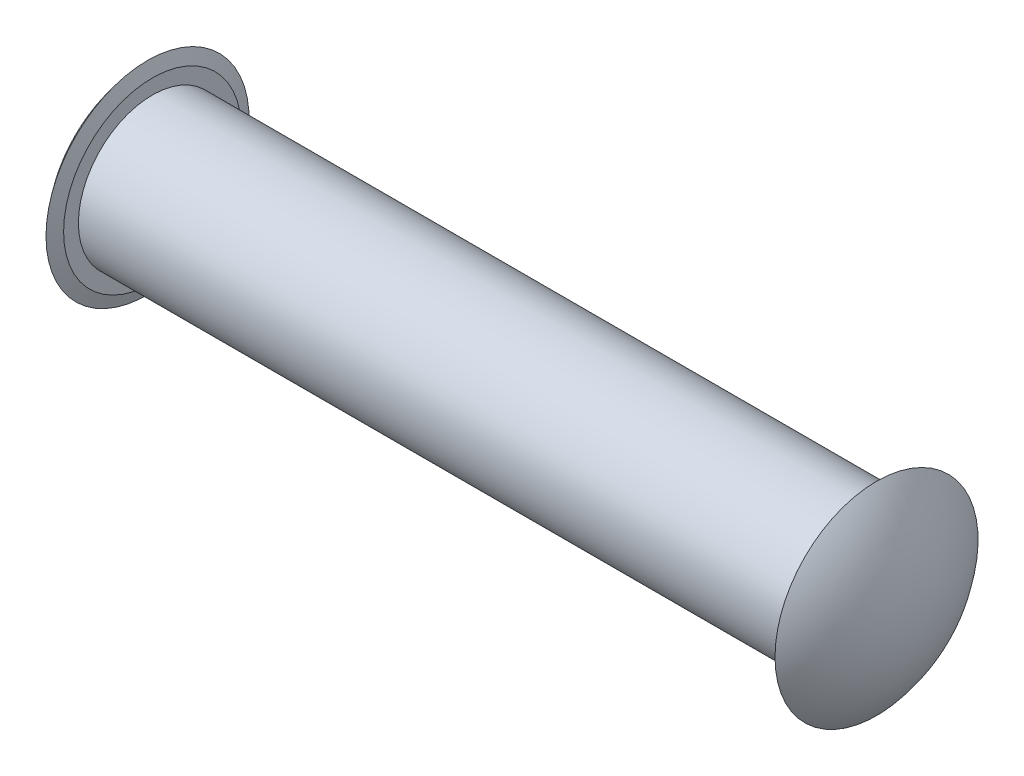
from build123d import *


with BuildPart() as part:
    # Esquisse1 → Base-R_volution (revolve)
    with BuildSketch(Plane.XY, mode=Mode.PRIVATE) as base_r_volution_sk:
        with BuildLine():
            Line((1.101569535, 24.196887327), (-32.898430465, 24.196887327))
            Line((-32.898430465, 24.196887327), (-32.898430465, 24.896887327))
            Line((-32.898430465, 24.896887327), (-33.130481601, 25.496887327))
            ThreePointArc((-33.130481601, 25.496887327), (-34.442391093, 23.254505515), (-34.898430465, 20.696887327))
            Line((-34.898430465, 20.696887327), (3.101569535, 20.696887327))
            ThreePointArc((3.101569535, 20.696887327), (2.645530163, 23.254505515), (1.333620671, 25.496887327))
            Line((1.333620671, 25.496887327), (1.101569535, 24.896887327))
            Line((1.101569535, 24.896887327), (1.101569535, 24.196887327))
        make_face()
    revolve(base_r_volution_sk.sketch.rotate(Axis((-37.484147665, 20.696887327, 0), (1, 0, 0)), 90), axis=Axis((-37.484147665, 20.696887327, 0), (1, 0, 0)))


solid = part.part
